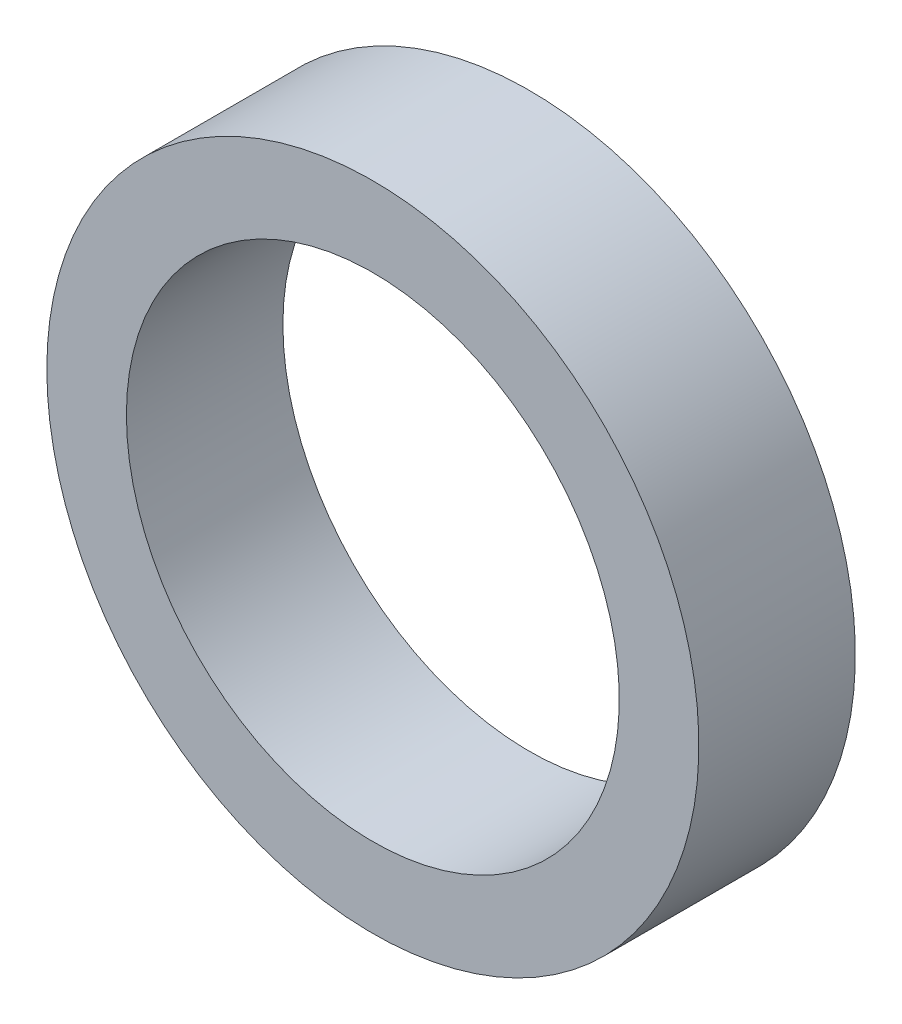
ISO-10303-21;
HEADER;
FILE_DESCRIPTION(('STEP AP214'),'2;1');
FILE_NAME('part.step','',(''),(''),'','','');
FILE_SCHEMA(('AUTOMOTIVE_DESIGN { 1 0 10303 214 1 1 1 1 }'));
ENDSEC;
DATA;
#1=APPLICATION_CONTEXT('core data for automotive mechanical design processes');
#2=APPLICATION_PROTOCOL_DEFINITION('international standard','automotive_design',2000,#1);
#3=PRODUCT_CONTEXT('',#1,'mechanical');
#4=PRODUCT('Part','Part','',(#3));
#5=PRODUCT_RELATED_PRODUCT_CATEGORY('part','',(#4));
#6=PRODUCT_DEFINITION_FORMATION('','',#4);
#7=PRODUCT_DEFINITION_CONTEXT('part definition',#1,'design');
#8=PRODUCT_DEFINITION('design','',#6,#7);
#9=PRODUCT_DEFINITION_SHAPE('','',#8);
#10=(LENGTH_UNIT() NAMED_UNIT(*) SI_UNIT(.MILLI.,.METRE.));
#11=(NAMED_UNIT(*) PLANE_ANGLE_UNIT() SI_UNIT($,.RADIAN.));
#12=(NAMED_UNIT(*) SI_UNIT($,.STERADIAN.) SOLID_ANGLE_UNIT());
#13=UNCERTAINTY_MEASURE_WITH_UNIT(LENGTH_MEASURE(1.E-05),#10,'distance_accuracy_value','');
#14=(GEOMETRIC_REPRESENTATION_CONTEXT(3) GLOBAL_UNCERTAINTY_ASSIGNED_CONTEXT((#13)) GLOBAL_UNIT_ASSIGNED_CONTEXT((#10,
#11,#12)) REPRESENTATION_CONTEXT('',''));
#15=CARTESIAN_POINT('',(0.,0.,0.));
#16=DIRECTION('',(0.,0.,1.));
#17=DIRECTION('',(1.,0.,0.));
#18=AXIS2_PLACEMENT_3D('',#15,#16,#17);
#19=CARTESIAN_POINT('',(0.,0.,3.81));
#20=DIRECTION('',(0.,0.,1.));
#21=DIRECTION('',(1.,0.,0.));
#22=AXIS2_PLACEMENT_3D('',#19,#20,#21);
#23=PLANE('',#22);
#24=CARTESIAN_POINT('',(0.,0.,3.81));
#25=DIRECTION('',(0.,0.,1.));
#26=DIRECTION('',(1.,0.,0.));
#27=AXIS2_PLACEMENT_3D('',#24,#25,#26);
#28=CIRCLE('',#27,7.9375);
#29=CARTESIAN_POINT('',(-7.9375,0.,3.81));
#30=VERTEX_POINT('',#29);
#31=EDGE_CURVE('E10',#30,#30,#28,.T.);
#32=ORIENTED_EDGE('',*,*,#31,.T.);
#33=EDGE_LOOP('',(#32));
#34=FACE_BOUND('',#33,.T.);
#35=CARTESIAN_POINT('',(0.,0.,3.81));
#36=DIRECTION('',(0.,0.,1.));
#37=DIRECTION('',(1.,0.,0.));
#38=AXIS2_PLACEMENT_3D('',#35,#36,#37);
#39=CIRCLE('',#38,6.);
#40=CARTESIAN_POINT('',(-6.,0.,3.81));
#41=VERTEX_POINT('',#40);
#42=EDGE_CURVE('E42',#41,#41,#39,.T.);
#43=ORIENTED_EDGE('',*,*,#42,.F.);
#44=EDGE_LOOP('',(#43));
#45=FACE_BOUND('',#44,.T.);
#46=ADVANCED_FACE('F31',(#34,#45),#23,.T.);
#47=CARTESIAN_POINT('',(0.,0.,0.));
#48=DIRECTION('',(0.,0.,1.));
#49=DIRECTION('',(1.,0.,0.));
#50=AXIS2_PLACEMENT_3D('',#47,#48,#49);
#51=PLANE('',#50);
#52=CARTESIAN_POINT('',(0.,0.,0.));
#53=DIRECTION('',(0.,0.,1.));
#54=DIRECTION('',(1.,0.,0.));
#55=AXIS2_PLACEMENT_3D('',#52,#53,#54);
#56=CIRCLE('',#55,7.9375);
#57=CARTESIAN_POINT('',(-7.9375,0.,0.));
#58=VERTEX_POINT('',#57);
#59=EDGE_CURVE('E35',#58,#58,#56,.T.);
#60=ORIENTED_EDGE('',*,*,#59,.F.);
#61=EDGE_LOOP('',(#60));
#62=FACE_BOUND('',#61,.T.);
#63=CARTESIAN_POINT('',(0.,0.,0.));
#64=DIRECTION('',(0.,0.,1.));
#65=DIRECTION('',(1.,0.,0.));
#66=AXIS2_PLACEMENT_3D('',#63,#64,#65);
#67=CIRCLE('',#66,6.);
#68=CARTESIAN_POINT('',(-6.,0.,0.));
#69=VERTEX_POINT('',#68);
#70=EDGE_CURVE('E44',#69,#69,#67,.T.);
#71=ORIENTED_EDGE('',*,*,#70,.T.);
#72=EDGE_LOOP('',(#71));
#73=FACE_BOUND('',#72,.T.);
#74=ADVANCED_FACE('F54',(#62,#73),#51,.F.);
#75=CARTESIAN_POINT('',(0.,0.,3.81));
#76=DIRECTION('',(0.,0.,-1.));
#77=DIRECTION('',(-1.,0.,0.));
#78=AXIS2_PLACEMENT_3D('',#75,#76,#77);
#79=CYLINDRICAL_SURFACE('',#78,7.9375);
#80=CARTESIAN_POINT('',(-7.9375,0.,3.81));
#81=CARTESIAN_POINT('',(-7.9375,0.,3.7703125));
#82=CARTESIAN_POINT('',(-7.9375,0.,3.730625));
#83=CARTESIAN_POINT('',(-7.9375,0.,3.65125));
#84=CARTESIAN_POINT('',(-7.9375,0.,3.6115625));
#85=CARTESIAN_POINT('',(-7.9375,0.,3.5321875));
#86=CARTESIAN_POINT('',(-7.9375,0.,3.4925));
#87=CARTESIAN_POINT('',(-7.9375,0.,3.413125));
#88=CARTESIAN_POINT('',(-7.9375,0.,3.3734375));
#89=CARTESIAN_POINT('',(-7.9375,0.,3.2940625));
#90=CARTESIAN_POINT('',(-7.9375,0.,3.254375));
#91=CARTESIAN_POINT('',(-7.9375,0.,3.175));
#92=CARTESIAN_POINT('',(-7.9375,0.,3.1353125));
#93=CARTESIAN_POINT('',(-7.9375,0.,3.0559375));
#94=CARTESIAN_POINT('',(-7.9375,0.,3.01625));
#95=CARTESIAN_POINT('',(-7.9375,0.,2.936875));
#96=CARTESIAN_POINT('',(-7.9375,0.,2.8971875));
#97=CARTESIAN_POINT('',(-7.9375,0.,2.8178125));
#98=CARTESIAN_POINT('',(-7.9375,0.,2.778125));
#99=CARTESIAN_POINT('',(-7.9375,0.,2.69875));
#100=CARTESIAN_POINT('',(-7.9375,0.,2.6590625));
#101=CARTESIAN_POINT('',(-7.9375,0.,2.5796875));
#102=CARTESIAN_POINT('',(-7.9375,0.,2.54));
#103=CARTESIAN_POINT('',(-7.9375,0.,2.460625));
#104=CARTESIAN_POINT('',(-7.9375,0.,2.4209375));
#105=CARTESIAN_POINT('',(-7.9375,0.,2.3415625));
#106=CARTESIAN_POINT('',(-7.9375,0.,2.301875));
#107=CARTESIAN_POINT('',(-7.9375,0.,2.2225));
#108=CARTESIAN_POINT('',(-7.9375,0.,2.1828125));
#109=CARTESIAN_POINT('',(-7.9375,0.,2.1034375));
#110=CARTESIAN_POINT('',(-7.9375,0.,2.06375));
#111=CARTESIAN_POINT('',(-7.9375,0.,1.984375));
#112=CARTESIAN_POINT('',(-7.9375,0.,1.9446875));
#113=CARTESIAN_POINT('',(-7.9375,0.,1.8653125));
#114=CARTESIAN_POINT('',(-7.9375,0.,1.825625));
#115=CARTESIAN_POINT('',(-7.9375,0.,1.74625));
#116=CARTESIAN_POINT('',(-7.9375,0.,1.7065625));
#117=CARTESIAN_POINT('',(-7.9375,0.,1.6271875));
#118=CARTESIAN_POINT('',(-7.9375,0.,1.5875));
#119=CARTESIAN_POINT('',(-7.9375,0.,1.508125));
#120=CARTESIAN_POINT('',(-7.9375,0.,1.4684375));
#121=CARTESIAN_POINT('',(-7.9375,0.,1.3890625));
#122=CARTESIAN_POINT('',(-7.9375,0.,1.349375));
#123=CARTESIAN_POINT('',(-7.9375,0.,1.27));
#124=CARTESIAN_POINT('',(-7.9375,0.,1.2303125));
#125=CARTESIAN_POINT('',(-7.9375,0.,1.1509375));
#126=CARTESIAN_POINT('',(-7.9375,0.,1.11125));
#127=CARTESIAN_POINT('',(-7.9375,0.,1.031875));
#128=CARTESIAN_POINT('',(-7.9375,0.,0.9921875));
#129=CARTESIAN_POINT('',(-7.9375,0.,0.9128125));
#130=CARTESIAN_POINT('',(-7.9375,0.,0.873125));
#131=CARTESIAN_POINT('',(-7.9375,0.,0.79375));
#132=CARTESIAN_POINT('',(-7.9375,0.,0.7540625));
#133=CARTESIAN_POINT('',(-7.9375,0.,0.6746875));
#134=CARTESIAN_POINT('',(-7.9375,0.,0.635));
#135=CARTESIAN_POINT('',(-7.9375,0.,0.555625));
#136=CARTESIAN_POINT('',(-7.9375,0.,0.5159375));
#137=CARTESIAN_POINT('',(-7.9375,0.,0.4365625));
#138=CARTESIAN_POINT('',(-7.9375,0.,0.396875));
#139=CARTESIAN_POINT('',(-7.9375,0.,0.3175));
#140=CARTESIAN_POINT('',(-7.9375,0.,0.2778125));
#141=CARTESIAN_POINT('',(-7.9375,0.,0.1984375));
#142=CARTESIAN_POINT('',(-7.9375,0.,0.15875));
#143=CARTESIAN_POINT('',(-7.9375,0.,0.0793749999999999));
#144=CARTESIAN_POINT('',(-7.9375,0.,0.0396874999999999));
#145=CARTESIAN_POINT('',(-7.9375,0.,0.));
#146=B_SPLINE_CURVE_WITH_KNOTS('',3,(#80,#81,#82,#83,#84,#85,#86,#87,#88,#89,#90,#91,#92,#93,
#94,#95,#96,#97,#98,#99,#100,#101,#102,#103,#104,#105,#106,#107,#108,#109,#110,#111,#112,#113,
#114,#115,#116,#117,#118,#119,#120,#121,#122,#123,#124,#125,#126,#127,#128,#129,#130,#131,#132,
#133,#134,#135,#136,#137,#138,#139,#140,#141,#142,#143,#144,#145),.UNSPECIFIED.,.F.,.F.,(4,2,2,
2,2,2,2,2,2,2,2,2,2,2,2,2,2,2,2,2,2,2,2,2,2,2,2,2,2,2,2,2,4),(0.,0.1190625,0.238125,0.3571875,
0.47625,0.595312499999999,0.714375,0.833437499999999,0.952499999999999,1.0715625,1.190625,
1.3096875,1.42875,1.5478125,1.666875,1.7859375,1.905,2.0240625,2.143125,2.2621875,2.38125,
2.5003125,2.619375,2.7384375,2.8575,2.9765625,3.095625,3.2146875,3.33375,3.4528125,3.571875,
3.6909375,3.81),.UNSPECIFIED.);
#147=EDGE_CURVE('BSEAM33',#30,#58,#146,.T.);
#148=ORIENTED_EDGE('',*,*,#31,.F.);
#149=ORIENTED_EDGE('',*,*,#59,.T.);
#150=ORIENTED_EDGE('',*,*,#147,.T.);
#151=ORIENTED_EDGE('',*,*,#147,.F.);
#152=EDGE_LOOP('',(#148,#150,#149,#151));
#153=FACE_BOUND('',#152,.T.);
#154=ADVANCED_FACE('F33',(#153),#79,.T.);
#155=CARTESIAN_POINT('',(0.,0.,3.81));
#156=DIRECTION('',(0.,0.,-1.));
#157=DIRECTION('',(-1.,0.,0.));
#158=AXIS2_PLACEMENT_3D('',#155,#156,#157);
#159=CYLINDRICAL_SURFACE('',#158,6.);
#160=CARTESIAN_POINT('',(-6.,0.,3.81));
#161=CARTESIAN_POINT('',(-6.,0.,3.7703125));
#162=CARTESIAN_POINT('',(-6.,0.,3.730625));
#163=CARTESIAN_POINT('',(-6.,0.,3.65125));
#164=CARTESIAN_POINT('',(-6.,0.,3.6115625));
#165=CARTESIAN_POINT('',(-6.,0.,3.5321875));
#166=CARTESIAN_POINT('',(-6.,0.,3.4925));
#167=CARTESIAN_POINT('',(-6.,0.,3.413125));
#168=CARTESIAN_POINT('',(-6.,0.,3.3734375));
#169=CARTESIAN_POINT('',(-6.,0.,3.2940625));
#170=CARTESIAN_POINT('',(-6.,0.,3.254375));
#171=CARTESIAN_POINT('',(-6.,0.,3.175));
#172=CARTESIAN_POINT('',(-6.,0.,3.1353125));
#173=CARTESIAN_POINT('',(-6.,0.,3.0559375));
#174=CARTESIAN_POINT('',(-6.,0.,3.01625));
#175=CARTESIAN_POINT('',(-6.,0.,2.936875));
#176=CARTESIAN_POINT('',(-6.,0.,2.8971875));
#177=CARTESIAN_POINT('',(-6.,0.,2.8178125));
#178=CARTESIAN_POINT('',(-6.,0.,2.778125));
#179=CARTESIAN_POINT('',(-6.,0.,2.69875));
#180=CARTESIAN_POINT('',(-6.,0.,2.6590625));
#181=CARTESIAN_POINT('',(-6.,0.,2.5796875));
#182=CARTESIAN_POINT('',(-6.,0.,2.54));
#183=CARTESIAN_POINT('',(-6.,0.,2.460625));
#184=CARTESIAN_POINT('',(-6.,0.,2.4209375));
#185=CARTESIAN_POINT('',(-6.,0.,2.3415625));
#186=CARTESIAN_POINT('',(-6.,0.,2.301875));
#187=CARTESIAN_POINT('',(-6.,0.,2.2225));
#188=CARTESIAN_POINT('',(-6.,0.,2.1828125));
#189=CARTESIAN_POINT('',(-6.,0.,2.1034375));
#190=CARTESIAN_POINT('',(-6.,0.,2.06375));
#191=CARTESIAN_POINT('',(-6.,0.,1.984375));
#192=CARTESIAN_POINT('',(-6.,0.,1.9446875));
#193=CARTESIAN_POINT('',(-6.,0.,1.8653125));
#194=CARTESIAN_POINT('',(-6.,0.,1.825625));
#195=CARTESIAN_POINT('',(-6.,0.,1.74625));
#196=CARTESIAN_POINT('',(-6.,0.,1.7065625));
#197=CARTESIAN_POINT('',(-6.,0.,1.6271875));
#198=CARTESIAN_POINT('',(-6.,0.,1.5875));
#199=CARTESIAN_POINT('',(-6.,0.,1.508125));
#200=CARTESIAN_POINT('',(-6.,0.,1.4684375));
#201=CARTESIAN_POINT('',(-6.,0.,1.3890625));
#202=CARTESIAN_POINT('',(-6.,0.,1.349375));
#203=CARTESIAN_POINT('',(-6.,0.,1.27));
#204=CARTESIAN_POINT('',(-6.,0.,1.2303125));
#205=CARTESIAN_POINT('',(-6.,0.,1.1509375));
#206=CARTESIAN_POINT('',(-6.,0.,1.11125));
#207=CARTESIAN_POINT('',(-6.,0.,1.031875));
#208=CARTESIAN_POINT('',(-6.,0.,0.9921875));
#209=CARTESIAN_POINT('',(-6.,0.,0.9128125));
#210=CARTESIAN_POINT('',(-6.,0.,0.873125));
#211=CARTESIAN_POINT('',(-6.,0.,0.79375));
#212=CARTESIAN_POINT('',(-6.,0.,0.7540625));
#213=CARTESIAN_POINT('',(-6.,0.,0.6746875));
#214=CARTESIAN_POINT('',(-6.,0.,0.635));
#215=CARTESIAN_POINT('',(-6.,0.,0.555625));
#216=CARTESIAN_POINT('',(-6.,0.,0.5159375));
#217=CARTESIAN_POINT('',(-6.,0.,0.4365625));
#218=CARTESIAN_POINT('',(-6.,0.,0.396875));
#219=CARTESIAN_POINT('',(-6.,0.,0.3175));
#220=CARTESIAN_POINT('',(-6.,0.,0.2778125));
#221=CARTESIAN_POINT('',(-6.,0.,0.1984375));
#222=CARTESIAN_POINT('',(-6.,0.,0.15875));
#223=CARTESIAN_POINT('',(-6.,0.,0.0793749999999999));
#224=CARTESIAN_POINT('',(-6.,0.,0.0396874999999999));
#225=CARTESIAN_POINT('',(-6.,0.,0.));
#226=B_SPLINE_CURVE_WITH_KNOTS('',3,(#160,#161,#162,#163,#164,#165,#166,#167,#168,#169,#170,
#171,#172,#173,#174,#175,#176,#177,#178,#179,#180,#181,#182,#183,#184,#185,#186,#187,#188,#189,
#190,#191,#192,#193,#194,#195,#196,#197,#198,#199,#200,#201,#202,#203,#204,#205,#206,#207,#208,
#209,#210,#211,#212,#213,#214,#215,#216,#217,#218,#219,#220,#221,#222,#223,#224,#225),
.UNSPECIFIED.,.F.,.F.,(4,2,2,2,2,2,2,2,2,2,2,2,2,2,2,2,2,2,2,2,2,2,2,2,2,2,2,2,2,2,2,2,4),(0.,
0.1190625,0.238125,0.3571875,0.47625,0.595312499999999,0.714375,0.833437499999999,
0.952499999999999,1.0715625,1.190625,1.3096875,1.42875,1.5478125,1.666875,1.7859375,1.905,
2.0240625,2.143125,2.2621875,2.38125,2.5003125,2.619375,2.7384375,2.8575,2.9765625,3.095625,
3.2146875,3.33375,3.4528125,3.571875,3.6909375,3.81),.UNSPECIFIED.);
#227=EDGE_CURVE('BSEAM50',#41,#69,#226,.T.);
#228=ORIENTED_EDGE('',*,*,#42,.T.);
#229=ORIENTED_EDGE('',*,*,#70,.F.);
#230=ORIENTED_EDGE('',*,*,#227,.T.);
#231=ORIENTED_EDGE('',*,*,#227,.F.);
#232=EDGE_LOOP('',(#228,#230,#229,#231));
#233=FACE_BOUND('',#232,.T.);
#234=ADVANCED_FACE('F50',(#233),#159,.F.);
#235=CLOSED_SHELL('',(#46,#74,#154,#234));
#236=MANIFOLD_SOLID_BREP('B2',#235);
#237=ADVANCED_BREP_SHAPE_REPRESENTATION('',(#18,#236),#14);
#238=SHAPE_DEFINITION_REPRESENTATION(#9,#237);
ENDSEC;
END-ISO-10303-21;
